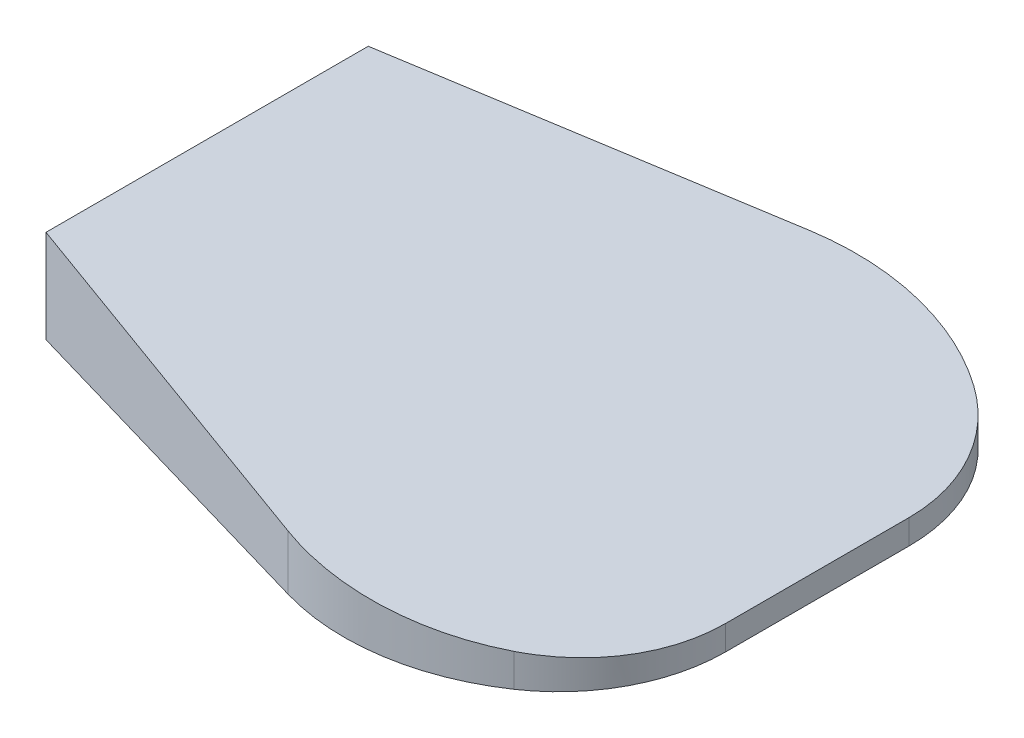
ISO-10303-21;
HEADER;
FILE_DESCRIPTION(('STEP AP214'),'2;1');
FILE_NAME('part.step','',(''),(''),'','','');
FILE_SCHEMA(('AUTOMOTIVE_DESIGN { 1 0 10303 214 1 1 1 1 }'));
ENDSEC;
DATA;
#1=APPLICATION_CONTEXT('core data for automotive mechanical design processes');
#2=APPLICATION_PROTOCOL_DEFINITION('international standard','automotive_design',2000,#1);
#3=PRODUCT_CONTEXT('',#1,'mechanical');
#4=PRODUCT('Part','Part','',(#3));
#5=PRODUCT_RELATED_PRODUCT_CATEGORY('part','',(#4));
#6=PRODUCT_DEFINITION_FORMATION('','',#4);
#7=PRODUCT_DEFINITION_CONTEXT('part definition',#1,'design');
#8=PRODUCT_DEFINITION('design','',#6,#7);
#9=PRODUCT_DEFINITION_SHAPE('','',#8);
#10=(LENGTH_UNIT() NAMED_UNIT(*) SI_UNIT(.MILLI.,.METRE.));
#11=(NAMED_UNIT(*) PLANE_ANGLE_UNIT() SI_UNIT($,.RADIAN.));
#12=(NAMED_UNIT(*) SI_UNIT($,.STERADIAN.) SOLID_ANGLE_UNIT());
#13=UNCERTAINTY_MEASURE_WITH_UNIT(LENGTH_MEASURE(1.E-05),#10,'distance_accuracy_value','');
#14=(GEOMETRIC_REPRESENTATION_CONTEXT(3) GLOBAL_UNCERTAINTY_ASSIGNED_CONTEXT((#13)) GLOBAL_UNIT_ASSIGNED_CONTEXT((#10,
#11,#12)) REPRESENTATION_CONTEXT('',''));
#15=CARTESIAN_POINT('',(0.,0.,0.));
#16=DIRECTION('',(0.,0.,1.));
#17=DIRECTION('',(1.,0.,0.));
#18=AXIS2_PLACEMENT_3D('',#15,#16,#17);
#19=CARTESIAN_POINT('',(-15.6751955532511,12.4272985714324,629.225791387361));
#20=DIRECTION('',(-0.111362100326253,-0.993779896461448,0.));
#21=DIRECTION('',(0.993779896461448,-0.111362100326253,0.));
#22=AXIS2_PLACEMENT_3D('',#19,#20,#21);
#23=PLANE('',#22);
#24=CARTESIAN_POINT('',(-117.34789230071,23.8206514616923,50.334720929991));
#25=DIRECTION('',(-0.111362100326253,-0.993779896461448,0.));
#26=DIRECTION('',(0.993779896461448,-0.111362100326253,0.));
#27=AXIS2_PLACEMENT_3D('',#24,#25,#26);
#28=ELLIPSE('',#27,92.2698213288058,91.6958934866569);
#29=CARTESIAN_POINT('',(-25.651998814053,13.5452903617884,50.334720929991));
#30=VERTEX_POINT('',#29);
#31=CARTESIAN_POINT('',(-66.0095714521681,18.0677244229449,126.31178124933));
#32=VERTEX_POINT('',#31);
#33=EDGE_CURVE('E95',#30,#32,#28,.T.);
#34=ORIENTED_EDGE('',*,*,#33,.F.);
#35=DIRECTION('',(0.,0.,1.));
#36=VECTOR('',#35,1.);
#37=CARTESIAN_POINT('',(-25.651998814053,13.5452903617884,-50.334720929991));
#38=LINE('',#37,#36);
#39=CARTESIAN_POINT('',(-25.651998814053,13.5452903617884,-50.334720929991));
#40=VERTEX_POINT('',#39);
#41=EDGE_CURVE('E101',#40,#30,#38,.T.);
#42=ORIENTED_EDGE('',*,*,#41,.F.);
#43=CARTESIAN_POINT('',(-117.34789230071,23.8206514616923,-50.334720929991));
#44=DIRECTION('',(-0.111362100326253,-0.993779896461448,0.));
#45=DIRECTION('',(0.993779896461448,-0.111362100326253,0.));
#46=AXIS2_PLACEMENT_3D('',#43,#44,#45);
#47=ELLIPSE('',#46,92.2698213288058,91.6958934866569);
#48=CARTESIAN_POINT('',(-66.0095714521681,18.0677244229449,-126.31178124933));
#49=VERTEX_POINT('',#48);
#50=EDGE_CURVE('E173',#49,#40,#47,.T.);
#51=ORIENTED_EDGE('',*,*,#50,.F.);
#52=CARTESIAN_POINT('',(-137.50252568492,26.0791619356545,-20.5072982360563));
#53=DIRECTION('',(-0.111362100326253,-0.993779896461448,0.));
#54=DIRECTION('',(0.993779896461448,-0.111362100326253,0.));
#55=AXIS2_PLACEMENT_3D('',#52,#53,#54);
#56=ELLIPSE('',#55,128.49353084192,127.694287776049);
#57=CARTESIAN_POINT('',(-173.17997315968,30.0771452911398,-143.11623295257));
#58=VERTEX_POINT('',#57);
#59=EDGE_CURVE('E169',#58,#49,#56,.T.);
#60=ORIENTED_EDGE('',*,*,#59,.F.);
#61=DIRECTION('',(0.954665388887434,-0.106978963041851,-0.277793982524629));
#62=VECTOR('',#61,1.);
#63=CARTESIAN_POINT('',(-177.359388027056,30.5454868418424,-141.900082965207));
#64=LINE('',#63,#62);
#65=CARTESIAN_POINT('',(-360.84561175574,51.1067915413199,-88.5082145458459));
#66=VERTEX_POINT('',#65);
#67=EDGE_CURVE('E164',#66,#58,#64,.T.);
#68=ORIENTED_EDGE('',*,*,#67,.F.);
#69=DIRECTION('',(0.,0.,-1.));
#70=VECTOR('',#69,1.);
#71=CARTESIAN_POINT('',(-360.84561175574,51.1067915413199,88.5082145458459));
#72=LINE('',#71,#70);
#73=CARTESIAN_POINT('',(-360.84561175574,51.1067915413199,88.5082145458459));
#74=VERTEX_POINT('',#73);
#75=EDGE_CURVE('E159',#74,#66,#72,.T.);
#76=ORIENTED_EDGE('',*,*,#75,.F.);
#77=DIRECTION('',(-0.954665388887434,0.106978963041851,-0.277793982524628));
#78=VECTOR('',#77,1.);
#79=CARTESIAN_POINT('',(-177.359388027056,30.5454868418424,141.900082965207));
#80=LINE('',#79,#78);
#81=CARTESIAN_POINT('',(-173.17997315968,30.0771452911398,143.11623295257));
#82=VERTEX_POINT('',#81);
#83=EDGE_CURVE('E47',#82,#74,#80,.T.);
#84=ORIENTED_EDGE('',*,*,#83,.F.);
#85=CARTESIAN_POINT('',(-137.50252568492,26.0791619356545,20.5072982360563));
#86=DIRECTION('',(-0.111362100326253,-0.993779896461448,0.));
#87=DIRECTION('',(0.993779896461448,-0.111362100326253,0.));
#88=AXIS2_PLACEMENT_3D('',#85,#86,#87);
#89=ELLIPSE('',#88,128.49353084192,127.694287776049);
#90=EDGE_CURVE('E11',#32,#82,#89,.T.);
#91=ORIENTED_EDGE('',*,*,#90,.F.);
#92=EDGE_LOOP('',(#34,#42,#51,#60,#68,#76,#84,#91));
#93=FACE_BOUND('',#92,.T.);
#94=ADVANCED_FACE('F32',(#93),#23,.F.);
#95=CARTESIAN_POINT('',(-117.34789230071,71.,50.334720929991));
#96=DIRECTION('',(0.,-1.,0.));
#97=DIRECTION('',(0.,0.,-1.));
#98=AXIS2_PLACEMENT_3D('',#95,#96,#97);
#99=CYLINDRICAL_SURFACE('',#98,91.6958934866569);
#100=DIRECTION('',(0.,-1.,0.));
#101=VECTOR('',#100,1.);
#102=CARTESIAN_POINT('',(-25.651998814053,71.,50.334720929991));
#103=LINE('',#102,#101);
#104=CARTESIAN_POINT('',(-25.651998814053,0.,50.334720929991));
#105=VERTEX_POINT('',#104);
#106=EDGE_CURVE('E40',#30,#105,#103,.T.);
#107=ORIENTED_EDGE('',*,*,#106,.F.);
#108=ORIENTED_EDGE('',*,*,#33,.T.);
#109=DIRECTION('',(0.,-1.,0.));
#110=VECTOR('',#109,1.);
#111=CARTESIAN_POINT('',(-66.0095714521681,71.,126.31178124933));
#112=LINE('',#111,#110);
#113=CARTESIAN_POINT('',(-66.0095714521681,0.,126.31178124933));
#114=VERTEX_POINT('',#113);
#115=EDGE_CURVE('E54',#32,#114,#112,.T.);
#116=ORIENTED_EDGE('',*,*,#115,.T.);
#117=CARTESIAN_POINT('',(-117.34789230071,0.,50.334720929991));
#118=DIRECTION('',(0.,1.,0.));
#119=DIRECTION('',(0.,0.,-1.));
#120=AXIS2_PLACEMENT_3D('',#117,#118,#119);
#121=CIRCLE('',#120,91.6958934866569);
#122=EDGE_CURVE('E100',#114,#105,#121,.T.);
#123=ORIENTED_EDGE('',*,*,#122,.T.);
#124=EDGE_LOOP('',(#107,#108,#116,#123));
#125=FACE_BOUND('',#124,.T.);
#126=ADVANCED_FACE('F34',(#125),#99,.T.);
#127=CARTESIAN_POINT('',(-25.651998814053,71.,-50.334720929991));
#128=DIRECTION('',(-1.,0.,0.));
#129=DIRECTION('',(0.,0.,1.));
#130=AXIS2_PLACEMENT_3D('',#127,#128,#129);
#131=PLANE('',#130);
#132=DIRECTION('',(0.,-1.,0.));
#133=VECTOR('',#132,1.);
#134=CARTESIAN_POINT('',(-25.651998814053,71.,-50.334720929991));
#135=LINE('',#134,#133);
#136=CARTESIAN_POINT('',(-25.651998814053,0.,-50.334720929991));
#137=VERTEX_POINT('',#136);
#138=EDGE_CURVE('E122',#40,#137,#135,.T.);
#139=ORIENTED_EDGE('',*,*,#138,.F.);
#140=ORIENTED_EDGE('',*,*,#41,.T.);
#141=ORIENTED_EDGE('',*,*,#106,.T.);
#142=DIRECTION('',(0.,0.,-1.));
#143=VECTOR('',#142,1.);
#144=CARTESIAN_POINT('',(-25.651998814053,0.,-50.334720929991));
#145=LINE('',#144,#143);
#146=EDGE_CURVE('E128',#105,#137,#145,.T.);
#147=ORIENTED_EDGE('',*,*,#146,.T.);
#148=EDGE_LOOP('',(#139,#140,#141,#147));
#149=FACE_BOUND('',#148,.T.);
#150=ADVANCED_FACE('F127',(#149),#131,.F.);
#151=CARTESIAN_POINT('',(-117.34789230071,71.,-50.334720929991));
#152=DIRECTION('',(0.,-1.,0.));
#153=DIRECTION('',(0.,0.,-1.));
#154=AXIS2_PLACEMENT_3D('',#151,#152,#153);
#155=CYLINDRICAL_SURFACE('',#154,91.6958934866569);
#156=DIRECTION('',(0.,-1.,0.));
#157=VECTOR('',#156,1.);
#158=CARTESIAN_POINT('',(-66.0095714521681,71.,-126.31178124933));
#159=LINE('',#158,#157);
#160=CARTESIAN_POINT('',(-66.0095714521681,0.,-126.31178124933));
#161=VERTEX_POINT('',#160);
#162=EDGE_CURVE('E120',#49,#161,#159,.T.);
#163=ORIENTED_EDGE('',*,*,#162,.F.);
#164=ORIENTED_EDGE('',*,*,#50,.T.);
#165=ORIENTED_EDGE('',*,*,#138,.T.);
#166=CARTESIAN_POINT('',(-117.34789230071,0.,-50.334720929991));
#167=DIRECTION('',(0.,1.,0.));
#168=DIRECTION('',(0.,0.,1.));
#169=AXIS2_PLACEMENT_3D('',#166,#167,#168);
#170=CIRCLE('',#169,91.6958934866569);
#171=EDGE_CURVE('E134',#137,#161,#170,.T.);
#172=ORIENTED_EDGE('',*,*,#171,.T.);
#173=EDGE_LOOP('',(#163,#164,#165,#172));
#174=FACE_BOUND('',#173,.T.);
#175=ADVANCED_FACE('F172',(#174),#155,.T.);
#176=CARTESIAN_POINT('',(-137.50252568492,71.,-20.5072982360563));
#177=DIRECTION('',(0.,-1.,0.));
#178=DIRECTION('',(0.,0.,-1.));
#179=AXIS2_PLACEMENT_3D('',#176,#177,#178);
#180=CYLINDRICAL_SURFACE('',#179,127.694287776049);
#181=DIRECTION('',(0.,-1.,0.));
#182=VECTOR('',#181,1.);
#183=CARTESIAN_POINT('',(-173.17997315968,71.,-143.11623295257));
#184=LINE('',#183,#182);
#185=CARTESIAN_POINT('',(-173.17997315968,0.,-143.11623295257));
#186=VERTEX_POINT('',#185);
#187=EDGE_CURVE('E118',#58,#186,#184,.T.);
#188=ORIENTED_EDGE('',*,*,#187,.F.);
#189=ORIENTED_EDGE('',*,*,#59,.T.);
#190=ORIENTED_EDGE('',*,*,#162,.T.);
#191=CARTESIAN_POINT('',(-137.50252568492,0.,-20.5072982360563));
#192=DIRECTION('',(0.,1.,0.));
#193=DIRECTION('',(0.,0.,1.));
#194=AXIS2_PLACEMENT_3D('',#191,#192,#193);
#195=CIRCLE('',#194,127.694287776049);
#196=EDGE_CURVE('E140',#161,#186,#195,.T.);
#197=ORIENTED_EDGE('',*,*,#196,.T.);
#198=EDGE_LOOP('',(#188,#189,#190,#197));
#199=FACE_BOUND('',#198,.T.);
#200=ADVANCED_FACE('F167',(#199),#180,.T.);
#201=CARTESIAN_POINT('',(-173.17997315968,71.,-143.11623295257));
#202=DIRECTION('',(0.279397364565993,0.,0.960175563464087));
#203=DIRECTION('',(0.960175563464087,0.,-0.279397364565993));
#204=AXIS2_PLACEMENT_3D('',#201,#202,#203);
#205=PLANE('',#204);
#206=DIRECTION('',(0.,-1.,0.));
#207=VECTOR('',#206,1.);
#208=CARTESIAN_POINT('',(-360.84561175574,71.,-88.5082145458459));
#209=LINE('',#208,#207);
#210=CARTESIAN_POINT('',(-360.84561175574,0.,-88.5082145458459));
#211=VERTEX_POINT('',#210);
#212=EDGE_CURVE('E116',#66,#211,#209,.T.);
#213=ORIENTED_EDGE('',*,*,#212,.F.);
#214=ORIENTED_EDGE('',*,*,#67,.T.);
#215=ORIENTED_EDGE('',*,*,#187,.T.);
#216=DIRECTION('',(-0.960175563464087,0.,0.279397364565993));
#217=VECTOR('',#216,1.);
#218=CARTESIAN_POINT('',(-173.17997315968,0.,-143.11623295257));
#219=LINE('',#218,#217);
#220=EDGE_CURVE('E143',#186,#211,#219,.T.);
#221=ORIENTED_EDGE('',*,*,#220,.T.);
#222=EDGE_LOOP('',(#213,#214,#215,#221));
#223=FACE_BOUND('',#222,.T.);
#224=ADVANCED_FACE('F162',(#223),#205,.F.);
#225=CARTESIAN_POINT('',(-360.84561175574,71.,88.5082145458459));
#226=DIRECTION('',(1.,0.,0.));
#227=DIRECTION('',(0.,0.,-1.));
#228=AXIS2_PLACEMENT_3D('',#225,#226,#227);
#229=PLANE('',#228);
#230=DIRECTION('',(0.,-1.,0.));
#231=VECTOR('',#230,1.);
#232=CARTESIAN_POINT('',(-360.84561175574,71.,88.5082145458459));
#233=LINE('',#232,#231);
#234=CARTESIAN_POINT('',(-360.84561175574,0.,88.5082145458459));
#235=VERTEX_POINT('',#234);
#236=EDGE_CURVE('E109',#74,#235,#233,.T.);
#237=ORIENTED_EDGE('',*,*,#236,.F.);
#238=ORIENTED_EDGE('',*,*,#75,.T.);
#239=ORIENTED_EDGE('',*,*,#212,.T.);
#240=DIRECTION('',(0.,0.,1.));
#241=VECTOR('',#240,1.);
#242=CARTESIAN_POINT('',(-360.84561175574,0.,88.5082145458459));
#243=LINE('',#242,#241);
#244=EDGE_CURVE('E146',#211,#235,#243,.T.);
#245=ORIENTED_EDGE('',*,*,#244,.T.);
#246=EDGE_LOOP('',(#237,#238,#239,#245));
#247=FACE_BOUND('',#246,.T.);
#248=ADVANCED_FACE('F156',(#247),#229,.F.);
#249=CARTESIAN_POINT('',(-173.17997315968,71.,143.11623295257));
#250=DIRECTION('',(0.279397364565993,0.,-0.960175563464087));
#251=DIRECTION('',(-0.960175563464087,0.,-0.279397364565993));
#252=AXIS2_PLACEMENT_3D('',#249,#250,#251);
#253=PLANE('',#252);
#254=DIRECTION('',(0.,-1.,0.));
#255=VECTOR('',#254,1.);
#256=CARTESIAN_POINT('',(-173.17997315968,71.,143.11623295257));
#257=LINE('',#256,#255);
#258=CARTESIAN_POINT('',(-173.17997315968,0.,143.11623295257));
#259=VERTEX_POINT('',#258);
#260=EDGE_CURVE('E107',#82,#259,#257,.T.);
#261=ORIENTED_EDGE('',*,*,#260,.F.);
#262=ORIENTED_EDGE('',*,*,#83,.T.);
#263=ORIENTED_EDGE('',*,*,#236,.T.);
#264=DIRECTION('',(0.960175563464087,0.,0.279397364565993));
#265=VECTOR('',#264,1.);
#266=CARTESIAN_POINT('',(-173.17997315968,0.,143.11623295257));
#267=LINE('',#266,#265);
#268=EDGE_CURVE('E111',#235,#259,#267,.T.);
#269=ORIENTED_EDGE('',*,*,#268,.T.);
#270=EDGE_LOOP('',(#261,#262,#263,#269));
#271=FACE_BOUND('',#270,.T.);
#272=ADVANCED_FACE('F151',(#271),#253,.F.);
#273=CARTESIAN_POINT('',(-137.50252568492,71.,20.5072982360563));
#274=DIRECTION('',(0.,-1.,0.));
#275=DIRECTION('',(0.,0.,-1.));
#276=AXIS2_PLACEMENT_3D('',#273,#274,#275);
#277=CYLINDRICAL_SURFACE('',#276,127.694287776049);
#278=ORIENTED_EDGE('',*,*,#115,.F.);
#279=ORIENTED_EDGE('',*,*,#90,.T.);
#280=ORIENTED_EDGE('',*,*,#260,.T.);
#281=CARTESIAN_POINT('',(-137.50252568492,0.,20.5072982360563));
#282=DIRECTION('',(0.,1.,0.));
#283=DIRECTION('',(0.,0.,-1.));
#284=AXIS2_PLACEMENT_3D('',#281,#282,#283);
#285=CIRCLE('',#284,127.694287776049);
#286=EDGE_CURVE('E105',#259,#114,#285,.T.);
#287=ORIENTED_EDGE('',*,*,#286,.T.);
#288=EDGE_LOOP('',(#278,#279,#280,#287));
#289=FACE_BOUND('',#288,.T.);
#290=ADVANCED_FACE('F103',(#289),#277,.T.);
#291=CARTESIAN_POINT('',(-117.34789230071,0.,50.334720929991));
#292=DIRECTION('',(0.,-1.,0.));
#293=DIRECTION('',(0.,0.,-1.));
#294=AXIS2_PLACEMENT_3D('',#291,#292,#293);
#295=PLANE('',#294);
#296=ORIENTED_EDGE('',*,*,#122,.F.);
#297=ORIENTED_EDGE('',*,*,#286,.F.);
#298=ORIENTED_EDGE('',*,*,#268,.F.);
#299=ORIENTED_EDGE('',*,*,#244,.F.);
#300=ORIENTED_EDGE('',*,*,#220,.F.);
#301=ORIENTED_EDGE('',*,*,#196,.F.);
#302=ORIENTED_EDGE('',*,*,#171,.F.);
#303=ORIENTED_EDGE('',*,*,#146,.F.);
#304=EDGE_LOOP('',(#296,#297,#298,#299,#300,#301,#302,#303));
#305=FACE_BOUND('',#304,.T.);
#306=ADVANCED_FACE('F131',(#305),#295,.T.);
#307=CLOSED_SHELL('',(#94,#126,#150,#175,#200,#224,#248,#272,#290,#306));
#308=MANIFOLD_SOLID_BREP('B2',#307);
#309=ADVANCED_BREP_SHAPE_REPRESENTATION('',(#18,#308),#14);
#310=SHAPE_DEFINITION_REPRESENTATION(#9,#309);
ENDSEC;
END-ISO-10303-21;
